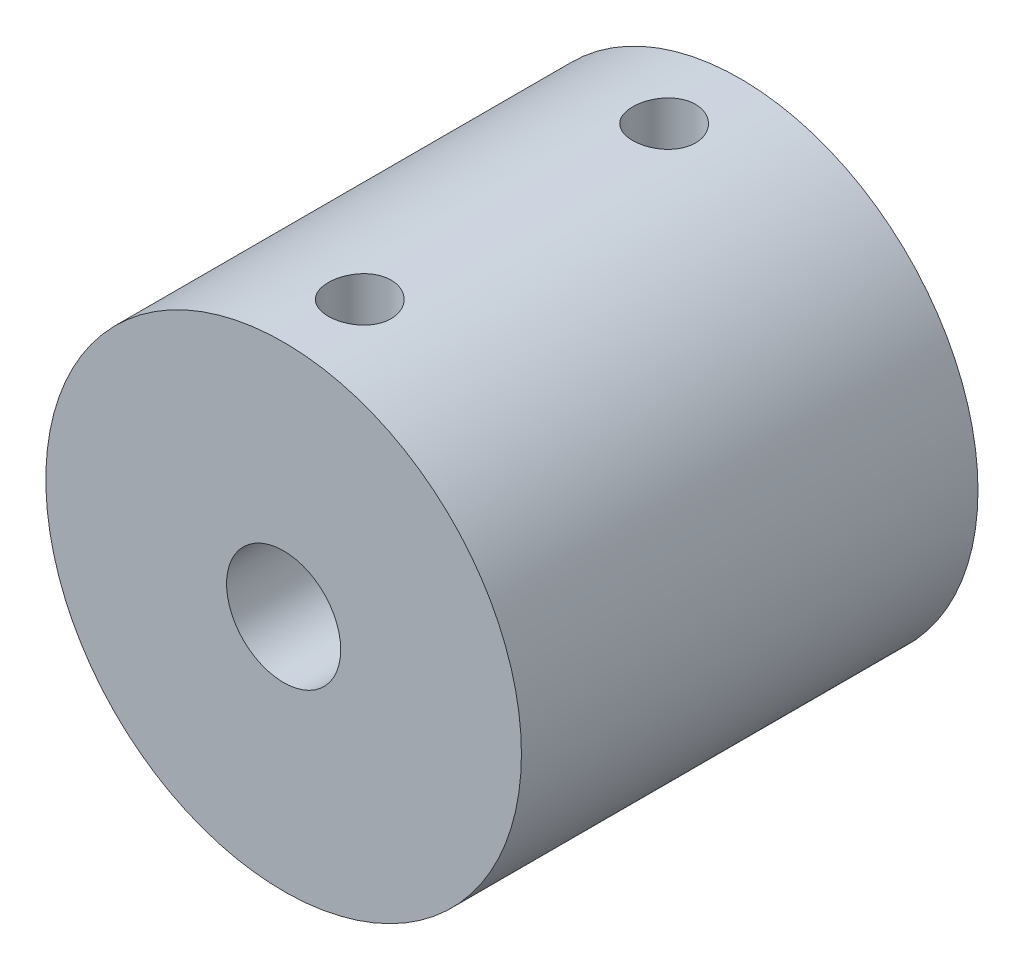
ISO-10303-21;
HEADER;
FILE_DESCRIPTION(('STEP AP214'),'2;1');
FILE_NAME('part.step','',(''),(''),'','','');
FILE_SCHEMA(('AUTOMOTIVE_DESIGN { 1 0 10303 214 1 1 1 1 }'));
ENDSEC;
DATA;
#1=APPLICATION_CONTEXT('core data for automotive mechanical design processes');
#2=APPLICATION_PROTOCOL_DEFINITION('international standard','automotive_design',2000,#1);
#3=PRODUCT_CONTEXT('',#1,'mechanical');
#4=PRODUCT('Part','Part','',(#3));
#5=PRODUCT_RELATED_PRODUCT_CATEGORY('part','',(#4));
#6=PRODUCT_DEFINITION_FORMATION('','',#4);
#7=PRODUCT_DEFINITION_CONTEXT('part definition',#1,'design');
#8=PRODUCT_DEFINITION('design','',#6,#7);
#9=PRODUCT_DEFINITION_SHAPE('','',#8);
#10=(LENGTH_UNIT() NAMED_UNIT(*) SI_UNIT(.MILLI.,.METRE.));
#11=(NAMED_UNIT(*) PLANE_ANGLE_UNIT() SI_UNIT($,.RADIAN.));
#12=(NAMED_UNIT(*) SI_UNIT($,.STERADIAN.) SOLID_ANGLE_UNIT());
#13=UNCERTAINTY_MEASURE_WITH_UNIT(LENGTH_MEASURE(1.E-05),#10,'distance_accuracy_value','');
#14=(GEOMETRIC_REPRESENTATION_CONTEXT(3) GLOBAL_UNCERTAINTY_ASSIGNED_CONTEXT((#13)) GLOBAL_UNIT_ASSIGNED_CONTEXT((#10,
#11,#12)) REPRESENTATION_CONTEXT('',''));
#15=CARTESIAN_POINT('',(0.,0.,0.));
#16=DIRECTION('',(0.,0.,1.));
#17=DIRECTION('',(1.,0.,0.));
#18=AXIS2_PLACEMENT_3D('',#15,#16,#17);
#19=CARTESIAN_POINT('',(0.,0.,24.));
#20=DIRECTION('',(0.,0.,1.));
#21=DIRECTION('',(1.,0.,0.));
#22=AXIS2_PLACEMENT_3D('',#19,#20,#21);
#23=PLANE('',#22);
#24=CARTESIAN_POINT('',(0.,0.,24.));
#25=DIRECTION('',(0.,0.,1.));
#26=DIRECTION('',(1.,0.,0.));
#27=AXIS2_PLACEMENT_3D('',#24,#25,#26);
#28=CIRCLE('',#27,12.5);
#29=CARTESIAN_POINT('',(12.5,0.,24.));
#30=VERTEX_POINT('',#29);
#31=EDGE_CURVE('E10',#30,#30,#28,.T.);
#32=ORIENTED_EDGE('',*,*,#31,.T.);
#33=EDGE_LOOP('',(#32));
#34=FACE_BOUND('',#33,.T.);
#35=CARTESIAN_POINT('',(0.,0.,24.));
#36=DIRECTION('',(0.,0.,1.));
#37=DIRECTION('',(1.,0.,0.));
#38=AXIS2_PLACEMENT_3D('',#35,#36,#37);
#39=CIRCLE('',#38,3.);
#40=CARTESIAN_POINT('',(3.,0.,24.));
#41=VERTEX_POINT('',#40);
#42=EDGE_CURVE('E51',#41,#41,#39,.T.);
#43=ORIENTED_EDGE('',*,*,#42,.F.);
#44=EDGE_LOOP('',(#43));
#45=FACE_BOUND('',#44,.T.);
#46=ADVANCED_FACE('F39',(#34,#45),#23,.T.);
#47=CARTESIAN_POINT('',(0.,0.,0.));
#48=DIRECTION('',(0.,0.,1.));
#49=DIRECTION('',(1.,0.,0.));
#50=AXIS2_PLACEMENT_3D('',#47,#48,#49);
#51=PLANE('',#50);
#52=CARTESIAN_POINT('',(0.,0.,0.));
#53=DIRECTION('',(0.,0.,1.));
#54=DIRECTION('',(1.,0.,0.));
#55=AXIS2_PLACEMENT_3D('',#52,#53,#54);
#56=CIRCLE('',#55,12.5);
#57=CARTESIAN_POINT('',(12.5,0.,0.));
#58=VERTEX_POINT('',#57);
#59=EDGE_CURVE('E44',#58,#58,#56,.T.);
#60=ORIENTED_EDGE('',*,*,#59,.F.);
#61=EDGE_LOOP('',(#60));
#62=FACE_BOUND('',#61,.T.);
#63=CARTESIAN_POINT('',(0.,0.,0.));
#64=DIRECTION('',(0.,0.,1.));
#65=DIRECTION('',(1.,0.,0.));
#66=AXIS2_PLACEMENT_3D('',#63,#64,#65);
#67=CIRCLE('',#66,3.);
#68=CARTESIAN_POINT('',(3.,0.,0.));
#69=VERTEX_POINT('',#68);
#70=EDGE_CURVE('E53',#69,#69,#67,.T.);
#71=ORIENTED_EDGE('',*,*,#70,.T.);
#72=EDGE_LOOP('',(#71));
#73=FACE_BOUND('',#72,.T.);
#74=ADVANCED_FACE('F87',(#62,#73),#51,.F.);
#75=CARTESIAN_POINT('',(0.,0.,24.));
#76=DIRECTION('',(0.,0.,-1.));
#77=DIRECTION('',(-1.,0.,0.));
#78=AXIS2_PLACEMENT_3D('',#75,#76,#77);
#79=CYLINDRICAL_SURFACE('',#78,12.5);
#80=CARTESIAN_POINT('',(0.,12.5,5.65));
#81=CARTESIAN_POINT('',(-0.0922509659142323,12.4999986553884,5.64999610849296));
#82=CARTESIAN_POINT('',(-0.184558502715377,12.498968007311,5.64223732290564));
#83=CARTESIAN_POINT('',(-0.366601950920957,12.4949556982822,5.61141019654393));
#84=CARTESIAN_POINT('',(-0.456335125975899,12.4919720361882,5.58832615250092));
#85=CARTESIAN_POINT('',(-0.630568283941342,12.4843896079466,5.52754306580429));
#86=CARTESIAN_POINT('',(-0.715071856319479,12.4797919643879,5.48985417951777));
#87=CARTESIAN_POINT('',(-0.876539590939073,12.4694920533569,5.40095418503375));
#88=CARTESIAN_POINT('',(-0.953504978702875,12.4637899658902,5.34974527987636));
#89=CARTESIAN_POINT('',(-1.09819718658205,12.4518781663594,5.2349246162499));
#90=CARTESIAN_POINT('',(-1.16587128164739,12.4456658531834,5.17124667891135));
#91=CARTESIAN_POINT('',(-1.28960557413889,12.4334545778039,5.0334377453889));
#92=CARTESIAN_POINT('',(-1.34566516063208,12.4274556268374,4.95930619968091));
#93=CARTESIAN_POINT('',(-1.44477796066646,12.4163248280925,4.80234850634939));
#94=CARTESIAN_POINT('',(-1.48778133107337,12.4111963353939,4.71949062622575));
#95=CARTESIAN_POINT('',(-1.55924262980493,12.4024218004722,4.54764984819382));
#96=CARTESIAN_POINT('',(-1.58770117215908,12.3987756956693,4.45866720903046));
#97=CARTESIAN_POINT('',(-1.62910377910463,12.3934038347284,4.27765215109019));
#98=CARTESIAN_POINT('',(-1.64213723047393,12.3916670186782,4.18564051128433));
#99=CARTESIAN_POINT('',(-1.6525963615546,12.3902766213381,4.00072085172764));
#100=CARTESIAN_POINT('',(-1.65002273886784,12.3906229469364,3.90781287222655));
#101=CARTESIAN_POINT('',(-1.62941406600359,12.3933495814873,3.72436300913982));
#102=CARTESIAN_POINT('',(-1.61147776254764,12.395716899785,3.63380981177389));
#103=CARTESIAN_POINT('',(-1.56080707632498,12.4021985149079,3.45700984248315));
#104=CARTESIAN_POINT('',(-1.52807236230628,12.4063128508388,3.3707631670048));
#105=CARTESIAN_POINT('',(-1.44862884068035,12.4158395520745,3.20471936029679));
#106=CARTESIAN_POINT('',(-1.40187740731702,12.4212558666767,3.12494285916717));
#107=CARTESIAN_POINT('',(-1.29575800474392,12.4327732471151,2.97433012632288));
#108=CARTESIAN_POINT('',(-1.23638939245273,12.4388743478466,2.90349435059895));
#109=CARTESIAN_POINT('',(-1.1061749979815,12.4511315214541,2.77220089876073));
#110=CARTESIAN_POINT('',(-1.03524415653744,12.4572876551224,2.711827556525));
#111=CARTESIAN_POINT('',(-0.88421085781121,12.4689172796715,2.6038303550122));
#112=CARTESIAN_POINT('',(-0.804108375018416,12.4743907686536,2.55620653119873));
#113=CARTESIAN_POINT('',(-0.636938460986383,12.484042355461,2.4750590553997));
#114=CARTESIAN_POINT('',(-0.549868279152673,12.4882199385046,2.44154100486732));
#115=CARTESIAN_POINT('',(-0.371267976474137,12.4948044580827,2.38962514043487));
#116=CARTESIAN_POINT('',(-0.27973808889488,12.4972114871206,2.37122653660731));
#117=CARTESIAN_POINT('',(-0.0955454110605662,12.4999716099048,2.35018188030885));
#118=CARTESIAN_POINT('',(-0.00289610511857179,12.5003398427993,2.34741971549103));
#119=CARTESIAN_POINT('',(0.181544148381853,12.4990218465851,2.35741945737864));
#120=CARTESIAN_POINT('',(0.273335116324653,12.4973356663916,2.37018099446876));
#121=CARTESIAN_POINT('',(0.453108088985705,12.4921077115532,2.4107693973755));
#122=CARTESIAN_POINT('',(0.541102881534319,12.4885727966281,2.43854058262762));
#123=CARTESIAN_POINT('',(0.711186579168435,12.4800429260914,2.50830185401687));
#124=CARTESIAN_POINT('',(0.793275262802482,12.4750479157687,2.55029247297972));
#125=CARTESIAN_POINT('',(0.949733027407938,12.4641165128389,2.64757933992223));
#126=CARTESIAN_POINT('',(1.02405527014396,12.4581748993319,2.70295031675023));
#127=CARTESIAN_POINT('',(1.16239311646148,12.4460304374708,2.82532084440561));
#128=CARTESIAN_POINT('',(1.22640826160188,12.4398275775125,2.89232091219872));
#129=CARTESIAN_POINT('',(1.34272949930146,12.427812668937,3.03656066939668));
#130=CARTESIAN_POINT('',(1.39495839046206,12.422003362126,3.11386287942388));
#131=CARTESIAN_POINT('',(1.48569034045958,12.4114793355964,3.27621075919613));
#132=CARTESIAN_POINT('',(1.52419370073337,12.40676459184,3.36125625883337));
#133=CARTESIAN_POINT('',(1.5862580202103,12.3989825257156,3.53643245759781));
#134=CARTESIAN_POINT('',(1.60986174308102,12.395910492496,3.62654778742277));
#135=CARTESIAN_POINT('',(1.64159408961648,12.3917484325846,3.80950632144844));
#136=CARTESIAN_POINT('',(1.64972352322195,12.390658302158,3.90234938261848));
#137=CARTESIAN_POINT('',(1.65026050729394,12.3905867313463,4.08735951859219));
#138=CARTESIAN_POINT('',(1.64278936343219,12.3915890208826,4.17952625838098));
#139=CARTESIAN_POINT('',(1.61259495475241,12.3955542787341,4.36128141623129));
#140=CARTESIAN_POINT('',(1.58987169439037,12.3985172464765,4.45086983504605));
#141=CARTESIAN_POINT('',(1.52985734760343,12.4060648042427,4.62490463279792));
#142=CARTESIAN_POINT('',(1.49257280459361,12.4106486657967,4.7093533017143));
#143=CARTESIAN_POINT('',(1.40450618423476,12.4209226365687,4.87081546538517));
#144=CARTESIAN_POINT('',(1.35372386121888,12.4266127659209,4.94782882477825));
#145=CARTESIAN_POINT('',(1.23965546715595,12.4385110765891,5.09285344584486));
#146=CARTESIAN_POINT('',(1.17627910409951,12.4447228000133,5.1607934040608));
#147=CARTESIAN_POINT('',(1.03901112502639,12.4569335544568,5.28511935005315));
#148=CARTESIAN_POINT('',(0.965117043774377,12.4629325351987,5.34150262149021));
#149=CARTESIAN_POINT('',(0.808549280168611,12.4740702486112,5.44132111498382));
#150=CARTESIAN_POINT('',(0.725839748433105,12.4792052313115,5.48470050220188));
#151=CARTESIAN_POINT('',(0.554286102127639,12.4879988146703,5.55689083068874));
#152=CARTESIAN_POINT('',(0.465448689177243,12.4916589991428,5.58571740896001));
#153=CARTESIAN_POINT('',(0.313472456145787,12.4962204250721,5.62117734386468));
#154=CARTESIAN_POINT('',(0.251287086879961,12.4976307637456,5.63197005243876));
#155=CARTESIAN_POINT('',(0.126076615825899,12.4995210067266,5.6463826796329));
#156=CARTESIAN_POINT('',(0.0630515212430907,12.5000009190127,5.6500026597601));
#157=CARTESIAN_POINT('',(0.,12.5,5.65));
#158=B_SPLINE_CURVE_WITH_KNOTS('',3,(#80,#81,#82,#83,#84,#85,#86,#87,#88,#89,#90,#91,#92,#93,
#94,#95,#96,#97,#98,#99,#100,#101,#102,#103,#104,#105,#106,#107,#108,#109,#110,#111,#112,#113,
#114,#115,#116,#117,#118,#119,#120,#121,#122,#123,#124,#125,#126,#127,#128,#129,#130,#131,#132,
#133,#134,#135,#136,#137,#138,#139,#140,#141,#142,#143,#144,#145,#146,#147,#148,#149,#150,#151,
#152,#153,#154,#155,#156,#157),.UNSPECIFIED.,.T.,.F.,(4,2,2,2,2,2,2,2,2,2,2,2,2,2,2,2,2,2,2,2,2,
2,2,2,2,2,2,2,2,2,2,2,2,2,2,2,2,2,4),(0.,0.27652256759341,0.553328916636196,0.829943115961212,
1.106512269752,1.38459116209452,1.66268467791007,1.94182686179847,2.22095726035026,
2.49846208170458,2.77595449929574,3.05167655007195,3.32740477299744,3.60398015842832,
3.88056964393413,4.15929423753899,4.43801960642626,4.71685555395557,4.99567693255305,
5.27242510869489,5.5491666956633,5.82488864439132,6.10062092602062,6.37793027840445,
6.65525196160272,6.93434056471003,7.21342303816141,7.49170082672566,7.76996404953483,
8.04607163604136,8.32217914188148,8.59816271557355,8.87415131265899,9.15219502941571,
9.43030402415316,9.70959057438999,9.98857638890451,10.1775751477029,10.3665722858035),.UNSPECIFIED.);
#159=CARTESIAN_POINT('',(0.,12.5,5.65));
#160=VERTEX_POINT('',#159);
#161=EDGE_CURVE('E104',#160,#160,#158,.T.);
#162=ORIENTED_EDGE('',*,*,#161,.T.);
#163=EDGE_LOOP('',(#162));
#164=FACE_BOUND('',#163,.T.);
#165=CARTESIAN_POINT('',(0.,12.5,21.65));
#166=CARTESIAN_POINT('',(-0.0922509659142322,12.4999986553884,21.649996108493));
#167=CARTESIAN_POINT('',(-0.184558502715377,12.498968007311,21.6422373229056));
#168=CARTESIAN_POINT('',(-0.366601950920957,12.4949556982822,21.6114101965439));
#169=CARTESIAN_POINT('',(-0.4563351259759,12.4919720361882,21.5883261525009));
#170=CARTESIAN_POINT('',(-0.630568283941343,12.4843896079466,21.5275430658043));
#171=CARTESIAN_POINT('',(-0.715071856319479,12.4797919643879,21.4898541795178));
#172=CARTESIAN_POINT('',(-0.876539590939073,12.4694920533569,21.4009541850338));
#173=CARTESIAN_POINT('',(-0.953504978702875,12.4637899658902,21.3497452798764));
#174=CARTESIAN_POINT('',(-1.09819718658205,12.4518781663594,21.2349246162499));
#175=CARTESIAN_POINT('',(-1.16587128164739,12.4456658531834,21.1712466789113));
#176=CARTESIAN_POINT('',(-1.28960557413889,12.4334545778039,21.0334377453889));
#177=CARTESIAN_POINT('',(-1.34566516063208,12.4274556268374,20.9593061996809));
#178=CARTESIAN_POINT('',(-1.44477796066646,12.4163248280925,20.8023485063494));
#179=CARTESIAN_POINT('',(-1.48778133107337,12.4111963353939,20.7194906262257));
#180=CARTESIAN_POINT('',(-1.55924262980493,12.4024218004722,20.5476498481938));
#181=CARTESIAN_POINT('',(-1.58770117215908,12.3987756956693,20.4586672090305));
#182=CARTESIAN_POINT('',(-1.62910377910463,12.3934038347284,20.2776521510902));
#183=CARTESIAN_POINT('',(-1.64213723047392,12.3916670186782,20.1856405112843));
#184=CARTESIAN_POINT('',(-1.6525963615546,12.3902766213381,20.0007208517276));
#185=CARTESIAN_POINT('',(-1.65002273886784,12.3906229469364,19.9078128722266));
#186=CARTESIAN_POINT('',(-1.6294140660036,12.3933495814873,19.7243630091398));
#187=CARTESIAN_POINT('',(-1.61147776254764,12.395716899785,19.6338098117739));
#188=CARTESIAN_POINT('',(-1.56080707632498,12.4021985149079,19.4570098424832));
#189=CARTESIAN_POINT('',(-1.52807236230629,12.4063128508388,19.3707631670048));
#190=CARTESIAN_POINT('',(-1.44862884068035,12.4158395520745,19.2047193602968));
#191=CARTESIAN_POINT('',(-1.40187740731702,12.4212558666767,19.1249428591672));
#192=CARTESIAN_POINT('',(-1.29575800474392,12.4327732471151,18.9743301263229));
#193=CARTESIAN_POINT('',(-1.23638939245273,12.4388743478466,18.9034943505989));
#194=CARTESIAN_POINT('',(-1.10617499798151,12.4511315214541,18.7722008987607));
#195=CARTESIAN_POINT('',(-1.03524415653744,12.4572876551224,18.711827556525));
#196=CARTESIAN_POINT('',(-0.884210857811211,12.4689172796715,18.6038303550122));
#197=CARTESIAN_POINT('',(-0.804108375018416,12.4743907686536,18.5562065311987));
#198=CARTESIAN_POINT('',(-0.636938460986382,12.484042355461,18.4750590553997));
#199=CARTESIAN_POINT('',(-0.549868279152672,12.4882199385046,18.4415410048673));
#200=CARTESIAN_POINT('',(-0.371267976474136,12.4948044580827,18.3896251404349));
#201=CARTESIAN_POINT('',(-0.27973808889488,12.4972114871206,18.3712265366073));
#202=CARTESIAN_POINT('',(-0.095545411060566,12.4999716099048,18.3501818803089));
#203=CARTESIAN_POINT('',(-0.00289610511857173,12.5003398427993,18.347419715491));
#204=CARTESIAN_POINT('',(0.181544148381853,12.4990218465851,18.3574194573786));
#205=CARTESIAN_POINT('',(0.273335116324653,12.4973356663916,18.3701809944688));
#206=CARTESIAN_POINT('',(0.453108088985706,12.4921077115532,18.4107693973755));
#207=CARTESIAN_POINT('',(0.54110288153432,12.4885727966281,18.4385405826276));
#208=CARTESIAN_POINT('',(0.711186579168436,12.4800429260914,18.5083018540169));
#209=CARTESIAN_POINT('',(0.793275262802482,12.4750479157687,18.5502924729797));
#210=CARTESIAN_POINT('',(0.949733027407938,12.4641165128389,18.6475793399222));
#211=CARTESIAN_POINT('',(1.02405527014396,12.4581748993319,18.7029503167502));
#212=CARTESIAN_POINT('',(1.16239311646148,12.4460304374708,18.8253208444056));
#213=CARTESIAN_POINT('',(1.22640826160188,12.4398275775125,18.8923209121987));
#214=CARTESIAN_POINT('',(1.34272949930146,12.427812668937,19.0365606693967));
#215=CARTESIAN_POINT('',(1.39495839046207,12.422003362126,19.1138628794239));
#216=CARTESIAN_POINT('',(1.48569034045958,12.4114793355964,19.2762107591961));
#217=CARTESIAN_POINT('',(1.52419370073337,12.40676459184,19.3612562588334));
#218=CARTESIAN_POINT('',(1.5862580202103,12.3989825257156,19.5364324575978));
#219=CARTESIAN_POINT('',(1.60986174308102,12.395910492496,19.6265477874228));
#220=CARTESIAN_POINT('',(1.64159408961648,12.3917484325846,19.8095063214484));
#221=CARTESIAN_POINT('',(1.64972352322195,12.390658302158,19.9023493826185));
#222=CARTESIAN_POINT('',(1.65026050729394,12.3905867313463,20.0873595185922));
#223=CARTESIAN_POINT('',(1.64278936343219,12.3915890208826,20.179526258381));
#224=CARTESIAN_POINT('',(1.61259495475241,12.3955542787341,20.3612814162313));
#225=CARTESIAN_POINT('',(1.58987169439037,12.3985172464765,20.4508698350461));
#226=CARTESIAN_POINT('',(1.52985734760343,12.4060648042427,20.6249046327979));
#227=CARTESIAN_POINT('',(1.49257280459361,12.4106486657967,20.7093533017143));
#228=CARTESIAN_POINT('',(1.40450618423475,12.4209226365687,20.8708154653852));
#229=CARTESIAN_POINT('',(1.35372386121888,12.4266127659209,20.9478288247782));
#230=CARTESIAN_POINT('',(1.23965546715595,12.4385110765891,21.0928534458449));
#231=CARTESIAN_POINT('',(1.17627910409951,12.4447228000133,21.1607934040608));
#232=CARTESIAN_POINT('',(1.03901112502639,12.4569335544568,21.2851193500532));
#233=CARTESIAN_POINT('',(0.965117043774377,12.4629325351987,21.3415026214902));
#234=CARTESIAN_POINT('',(0.808549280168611,12.4740702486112,21.4413211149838));
#235=CARTESIAN_POINT('',(0.725839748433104,12.4792052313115,21.4847005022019));
#236=CARTESIAN_POINT('',(0.554286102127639,12.4879988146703,21.5568908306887));
#237=CARTESIAN_POINT('',(0.465448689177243,12.4916589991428,21.58571740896));
#238=CARTESIAN_POINT('',(0.313472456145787,12.4962204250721,21.6211773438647));
#239=CARTESIAN_POINT('',(0.251287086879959,12.4976307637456,21.6319700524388));
#240=CARTESIAN_POINT('',(0.126076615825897,12.4995210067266,21.6463826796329));
#241=CARTESIAN_POINT('',(0.06305152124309,12.5000009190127,21.6500026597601));
#242=CARTESIAN_POINT('',(0.,12.5,21.65));
#243=B_SPLINE_CURVE_WITH_KNOTS('',3,(#165,#166,#167,#168,#169,#170,#171,#172,#173,#174,#175,
#176,#177,#178,#179,#180,#181,#182,#183,#184,#185,#186,#187,#188,#189,#190,#191,#192,#193,#194,
#195,#196,#197,#198,#199,#200,#201,#202,#203,#204,#205,#206,#207,#208,#209,#210,#211,#212,#213,
#214,#215,#216,#217,#218,#219,#220,#221,#222,#223,#224,#225,#226,#227,#228,#229,#230,#231,#232,
#233,#234,#235,#236,#237,#238,#239,#240,#241,#242),.UNSPECIFIED.,.T.,.F.,(4,2,2,2,2,2,2,2,2,2,2,
2,2,2,2,2,2,2,2,2,2,2,2,2,2,2,2,2,2,2,2,2,2,2,2,2,2,2,4),(0.,0.27652256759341,0.553328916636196,
0.829943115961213,1.106512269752,1.38459116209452,1.66268467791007,1.94182686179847,
2.22095726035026,2.49846208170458,2.77595449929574,3.05167655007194,3.32740477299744,
3.60398015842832,3.88056964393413,4.15929423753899,4.43801960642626,4.71685555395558,
4.99567693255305,5.27242510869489,5.54916669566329,5.82488864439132,6.10062092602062,
6.37793027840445,6.65525196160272,6.93434056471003,7.21342303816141,7.49170082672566,
7.76996404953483,8.04607163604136,8.32217914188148,8.59816271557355,8.87415131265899,
9.15219502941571,9.43030402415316,9.70959057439,9.98857638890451,10.1775751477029,
10.3665722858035),.UNSPECIFIED.);
#244=CARTESIAN_POINT('',(0.,12.5,21.65));
#245=VERTEX_POINT('',#244);
#246=EDGE_CURVE('E56',#245,#245,#243,.T.);
#247=ORIENTED_EDGE('',*,*,#246,.T.);
#248=EDGE_LOOP('',(#247));
#249=FACE_BOUND('',#248,.T.);
#250=ORIENTED_EDGE('',*,*,#31,.F.);
#251=EDGE_LOOP('',(#250));
#252=FACE_BOUND('',#251,.T.);
#253=ORIENTED_EDGE('',*,*,#59,.T.);
#254=EDGE_LOOP('',(#253));
#255=FACE_BOUND('',#254,.T.);
#256=ADVANCED_FACE('F41',(#164,#249,#252,#255),#79,.T.);
#257=CARTESIAN_POINT('',(0.,0.,24.));
#258=DIRECTION('',(0.,0.,-1.));
#259=DIRECTION('',(-1.,0.,0.));
#260=AXIS2_PLACEMENT_3D('',#257,#258,#259);
#261=CYLINDRICAL_SURFACE('',#260,3.);
#262=CARTESIAN_POINT('',(0.,3.,5.65));
#263=CARTESIAN_POINT('',(-0.0856699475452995,2.99999513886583,5.64999461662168));
#264=CARTESIAN_POINT('',(-0.171409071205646,2.99629302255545,5.64328935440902));
#265=CARTESIAN_POINT('',(-0.340286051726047,2.9818478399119,5.61679778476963));
#266=CARTESIAN_POINT('',(-0.42342019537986,2.97109516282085,5.59699362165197));
#267=CARTESIAN_POINT('',(-0.584401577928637,2.9436571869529,5.54534553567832));
#268=CARTESIAN_POINT('',(-0.662269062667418,2.9269963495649,5.51355122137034));
#269=CARTESIAN_POINT('',(-0.811408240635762,2.8892116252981,5.43912133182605));
#270=CARTESIAN_POINT('',(-0.882679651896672,2.86808754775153,5.39648529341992));
#271=CARTESIAN_POINT('',(-1.02211619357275,2.82153252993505,5.29828466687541));
#272=CARTESIAN_POINT('',(-1.08973037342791,2.79590528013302,5.24203247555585));
#273=CARTESIAN_POINT('',(-1.21508634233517,2.74375354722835,5.1197083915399));
#274=CARTESIAN_POINT('',(-1.2728189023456,2.71722825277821,5.05362742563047));
#275=CARTESIAN_POINT('',(-1.38251917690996,2.66321895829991,4.90577401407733));
#276=CARTESIAN_POINT('',(-1.43335857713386,2.635897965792,4.82309703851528));
#277=CARTESIAN_POINT('',(-1.52021547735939,2.58678336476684,4.64877263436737));
#278=CARTESIAN_POINT('',(-1.5562446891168,2.56498539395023,4.55713236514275));
#279=CARTESIAN_POINT('',(-1.60989890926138,2.53163475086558,4.3732305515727));
#280=CARTESIAN_POINT('',(-1.62854263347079,2.51952192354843,4.28137384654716));
#281=CARTESIAN_POINT('',(-1.64991120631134,2.5055890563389,4.09511055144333));
#282=CARTESIAN_POINT('',(-1.65265887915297,2.50375425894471,4.00070781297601));
#283=CARTESIAN_POINT('',(-1.64290000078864,2.51015646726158,3.82757164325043));
#284=CARTESIAN_POINT('',(-1.63265157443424,2.51690299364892,3.74864024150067));
#285=CARTESIAN_POINT('',(-1.60118639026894,2.53703527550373,3.59387058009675));
#286=CARTESIAN_POINT('',(-1.5799646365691,2.55042405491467,3.5180337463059));
#287=CARTESIAN_POINT('',(-1.52687641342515,2.58256130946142,3.3695176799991));
#288=CARTESIAN_POINT('',(-1.49479033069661,2.60141910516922,3.2969417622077));
#289=CARTESIAN_POINT('',(-1.42107429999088,2.64240902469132,3.15782897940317));
#290=CARTESIAN_POINT('',(-1.37944023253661,2.66454256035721,3.09129473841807));
#291=CARTESIAN_POINT('',(-1.28018349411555,2.71379040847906,2.95510521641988));
#292=CARTESIAN_POINT('',(-1.22107458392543,2.74113957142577,2.88661394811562));
#293=CARTESIAN_POINT('',(-1.09224532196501,2.79497377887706,2.75997341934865));
#294=CARTESIAN_POINT('',(-1.02251777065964,2.82145822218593,2.70183123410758));
#295=CARTESIAN_POINT('',(-0.868605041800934,2.87272134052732,2.59378517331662));
#296=CARTESIAN_POINT('',(-0.783763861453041,2.89726648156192,2.54469535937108));
#297=CARTESIAN_POINT('',(-0.605352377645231,2.93971528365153,2.46191924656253));
#298=CARTESIAN_POINT('',(-0.511790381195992,2.95762518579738,2.42821846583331));
#299=CARTESIAN_POINT('',(-0.327907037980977,2.98333345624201,2.38038778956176));
#300=CARTESIAN_POINT('',(-0.238095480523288,2.99191822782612,2.36472744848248));
#301=CARTESIAN_POINT('',(-0.0567325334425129,3.00083376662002,2.34846917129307));
#302=CARTESIAN_POINT('',(0.0348177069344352,3.00116980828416,2.34786161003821));
#303=CARTESIAN_POINT('',(0.207487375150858,2.99394177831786,2.36103451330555));
#304=CARTESIAN_POINT('',(0.28875177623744,2.98714659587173,2.37341460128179));
#305=CARTESIAN_POINT('',(0.447838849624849,2.96746793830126,2.40984259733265));
#306=CARTESIAN_POINT('',(0.525661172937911,2.95458384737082,2.43389168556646));
#307=CARTESIAN_POINT('',(0.677753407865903,2.92349378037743,2.49335761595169));
#308=CARTESIAN_POINT('',(0.751904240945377,2.90517475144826,2.52901769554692));
#309=CARTESIAN_POINT('',(0.893363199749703,2.86484215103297,2.61037134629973));
#310=CARTESIAN_POINT('',(0.960668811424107,2.8428272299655,2.65606858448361));
#311=CARTESIAN_POINT('',(1.09455456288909,2.79420331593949,2.76204471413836));
#312=CARTESIAN_POINT('',(1.16021004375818,2.76735592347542,2.823383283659));
#313=CARTESIAN_POINT('',(1.28079913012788,2.71365440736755,2.9559244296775));
#314=CARTESIAN_POINT('',(1.33572155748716,2.6868003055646,3.02713715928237));
#315=CARTESIAN_POINT('',(1.43747254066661,2.63385875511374,3.18416419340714));
#316=CARTESIAN_POINT('',(1.48334076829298,2.60799295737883,3.27068307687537));
#317=CARTESIAN_POINT('',(1.55942876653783,2.56323063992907,3.45199407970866));
#318=CARTESIAN_POINT('',(1.58967133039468,2.54432398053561,3.54677391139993));
#319=CARTESIAN_POINT('',(1.6306246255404,2.51825420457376,3.73226237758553));
#320=CARTESIAN_POINT('',(1.64294477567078,2.51013022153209,3.8224747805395));
#321=CARTESIAN_POINT('',(1.65249034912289,2.50386093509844,4.00401046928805));
#322=CARTESIAN_POINT('',(1.64972872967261,2.50570706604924,4.09533273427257));
#323=CARTESIAN_POINT('',(1.63075691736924,2.51807870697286,4.26321952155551));
#324=CARTESIAN_POINT('',(1.61642825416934,2.52738874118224,4.34010097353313));
#325=CARTESIAN_POINT('',(1.57741079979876,2.55192145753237,4.49019541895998));
#326=CARTESIAN_POINT('',(1.55271775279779,2.56714656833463,4.56340689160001));
#327=CARTESIAN_POINT('',(1.492056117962,2.60289749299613,4.70913964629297));
#328=CARTESIAN_POINT('',(1.45548954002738,2.62369085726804,4.7813439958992));
#329=CARTESIAN_POINT('',(1.37268509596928,2.66794671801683,4.91907602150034));
#330=CARTESIAN_POINT('',(1.32644209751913,2.69141062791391,4.98460012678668));
#331=CARTESIAN_POINT('',(1.21715006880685,2.74276036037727,5.11784973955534));
#332=CARTESIAN_POINT('',(1.15260264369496,2.77076245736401,5.18430823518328));
#333=CARTESIAN_POINT('',(1.01279351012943,2.82486614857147,5.30588442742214));
#334=CARTESIAN_POINT('',(0.937524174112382,2.85096636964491,5.360993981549));
#335=CARTESIAN_POINT('',(0.774887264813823,2.89948189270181,5.45993803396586));
#336=CARTESIAN_POINT('',(0.687189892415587,2.92173740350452,5.50331356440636));
#337=CARTESIAN_POINT('',(0.504223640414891,2.95878417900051,5.57410971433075));
#338=CARTESIAN_POINT('',(0.408974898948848,2.97359457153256,5.60157124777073));
#339=CARTESIAN_POINT('',(0.26051061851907,2.98911434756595,5.63014205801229));
#340=CARTESIAN_POINT('',(0.20878305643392,2.99318008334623,5.63757243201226));
#341=CARTESIAN_POINT('',(0.104712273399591,2.99862437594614,5.64750301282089));
#342=CARTESIAN_POINT('',(0.0523690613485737,3.00000297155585,5.65000329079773));
#343=CARTESIAN_POINT('',(0.,3.,5.65));
#344=B_SPLINE_CURVE_WITH_KNOTS('',3,(#262,#263,#264,#265,#266,#267,#268,#269,#270,#271,#272,
#273,#274,#275,#276,#277,#278,#279,#280,#281,#282,#283,#284,#285,#286,#287,#288,#289,#290,#291,
#292,#293,#294,#295,#296,#297,#298,#299,#300,#301,#302,#303,#304,#305,#306,#307,#308,#309,#310,
#311,#312,#313,#314,#315,#316,#317,#318,#319,#320,#321,#322,#323,#324,#325,#326,#327,#328,#329,
#330,#331,#332,#333,#334,#335,#336,#337,#338,#339,#340,#341,#342,#343),.UNSPECIFIED.,.T.,.F.,(4,
2,2,2,2,2,2,2,2,2,2,2,2,2,2,2,2,2,2,2,2,2,2,2,2,2,2,2,2,2,2,2,2,2,2,2,2,2,2,2,4),(0.,
0.256799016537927,0.513948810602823,0.770046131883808,1.02615439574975,1.29988051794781,
1.57386091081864,1.87483382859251,2.17556827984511,2.45730761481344,2.7386423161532,
2.97715628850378,3.21577894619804,3.4595457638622,3.70341795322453,3.98576982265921,
4.26831398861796,4.5698079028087,4.8710175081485,5.14417314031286,5.41715410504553,
5.66345591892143,5.90978264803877,6.16164305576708,6.41359563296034,6.69375293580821,
6.97420047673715,7.27643629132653,7.57822997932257,7.85076329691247,8.12306250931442,
8.35830132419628,8.59363682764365,8.84338665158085,9.09326927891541,9.38234984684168,
9.6716371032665,9.97098879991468,10.2695674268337,10.4265480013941,10.5835263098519),.UNSPECIFIED.);
#345=CARTESIAN_POINT('',(0.,3.,5.65));
#346=VERTEX_POINT('',#345);
#347=EDGE_CURVE('E109',#346,#346,#344,.T.);
#348=ORIENTED_EDGE('',*,*,#347,.F.);
#349=EDGE_LOOP('',(#348));
#350=FACE_BOUND('',#349,.T.);
#351=CARTESIAN_POINT('',(0.,3.,21.65));
#352=CARTESIAN_POINT('',(-0.0856699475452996,2.99999513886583,21.6499946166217));
#353=CARTESIAN_POINT('',(-0.171409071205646,2.99629302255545,21.643289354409));
#354=CARTESIAN_POINT('',(-0.340286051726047,2.9818478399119,21.6167977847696));
#355=CARTESIAN_POINT('',(-0.42342019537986,2.97109516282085,21.596993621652));
#356=CARTESIAN_POINT('',(-0.584401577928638,2.9436571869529,21.5453455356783));
#357=CARTESIAN_POINT('',(-0.66226906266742,2.92699634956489,21.5135512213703));
#358=CARTESIAN_POINT('',(-0.811408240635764,2.8892116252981,21.4391213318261));
#359=CARTESIAN_POINT('',(-0.882679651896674,2.86808754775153,21.3964852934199));
#360=CARTESIAN_POINT('',(-1.02211619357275,2.82153252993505,21.2982846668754));
#361=CARTESIAN_POINT('',(-1.08973037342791,2.79590528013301,21.2420324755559));
#362=CARTESIAN_POINT('',(-1.21508634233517,2.74375354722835,21.1197083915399));
#363=CARTESIAN_POINT('',(-1.2728189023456,2.71722825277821,21.0536274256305));
#364=CARTESIAN_POINT('',(-1.38251917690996,2.66321895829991,20.9057740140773));
#365=CARTESIAN_POINT('',(-1.43335857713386,2.635897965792,20.8230970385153));
#366=CARTESIAN_POINT('',(-1.52021547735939,2.58678336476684,20.6487726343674));
#367=CARTESIAN_POINT('',(-1.5562446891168,2.56498539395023,20.5571323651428));
#368=CARTESIAN_POINT('',(-1.60989890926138,2.53163475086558,20.3732305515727));
#369=CARTESIAN_POINT('',(-1.62854263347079,2.51952192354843,20.2813738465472));
#370=CARTESIAN_POINT('',(-1.64991120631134,2.5055890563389,20.0951105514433));
#371=CARTESIAN_POINT('',(-1.65265887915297,2.50375425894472,20.000707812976));
#372=CARTESIAN_POINT('',(-1.64290000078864,2.51015646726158,19.8275716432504));
#373=CARTESIAN_POINT('',(-1.63265157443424,2.51690299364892,19.7486402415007));
#374=CARTESIAN_POINT('',(-1.60118639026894,2.53703527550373,19.5938705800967));
#375=CARTESIAN_POINT('',(-1.5799646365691,2.55042405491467,19.5180337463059));
#376=CARTESIAN_POINT('',(-1.52687641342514,2.58256130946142,19.3695176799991));
#377=CARTESIAN_POINT('',(-1.49479033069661,2.60141910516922,19.2969417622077));
#378=CARTESIAN_POINT('',(-1.42107429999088,2.64240902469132,19.1578289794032));
#379=CARTESIAN_POINT('',(-1.3794402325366,2.66454256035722,19.0912947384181));
#380=CARTESIAN_POINT('',(-1.28018349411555,2.71379040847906,18.9551052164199));
#381=CARTESIAN_POINT('',(-1.22107458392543,2.74113957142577,18.8866139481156));
#382=CARTESIAN_POINT('',(-1.09224532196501,2.79497377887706,18.7599734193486));
#383=CARTESIAN_POINT('',(-1.02251777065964,2.82145822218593,18.7018312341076));
#384=CARTESIAN_POINT('',(-0.868605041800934,2.87272134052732,18.5937851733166));
#385=CARTESIAN_POINT('',(-0.78376386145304,2.89726648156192,18.5446953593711));
#386=CARTESIAN_POINT('',(-0.605352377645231,2.93971528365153,18.4619192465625));
#387=CARTESIAN_POINT('',(-0.511790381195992,2.95762518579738,18.4282184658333));
#388=CARTESIAN_POINT('',(-0.327907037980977,2.98333345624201,18.3803877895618));
#389=CARTESIAN_POINT('',(-0.238095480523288,2.99191822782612,18.3647274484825));
#390=CARTESIAN_POINT('',(-0.0567325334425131,3.00083376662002,18.3484691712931));
#391=CARTESIAN_POINT('',(0.0348177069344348,3.00116980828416,18.3478616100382));
#392=CARTESIAN_POINT('',(0.207487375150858,2.99394177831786,18.3610345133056));
#393=CARTESIAN_POINT('',(0.28875177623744,2.98714659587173,18.3734146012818));
#394=CARTESIAN_POINT('',(0.447838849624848,2.96746793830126,18.4098425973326));
#395=CARTESIAN_POINT('',(0.525661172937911,2.95458384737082,18.4338916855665));
#396=CARTESIAN_POINT('',(0.677753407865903,2.92349378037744,18.4933576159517));
#397=CARTESIAN_POINT('',(0.751904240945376,2.90517475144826,18.5290176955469));
#398=CARTESIAN_POINT('',(0.893363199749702,2.86484215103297,18.6103713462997));
#399=CARTESIAN_POINT('',(0.960668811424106,2.8428272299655,18.6560685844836));
#400=CARTESIAN_POINT('',(1.09455456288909,2.79420331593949,18.7620447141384));
#401=CARTESIAN_POINT('',(1.16021004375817,2.76735592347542,18.823383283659));
#402=CARTESIAN_POINT('',(1.28079913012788,2.71365440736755,18.9559244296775));
#403=CARTESIAN_POINT('',(1.33572155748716,2.6868003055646,19.0271371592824));
#404=CARTESIAN_POINT('',(1.43747254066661,2.63385875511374,19.1841641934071));
#405=CARTESIAN_POINT('',(1.48334076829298,2.60799295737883,19.2706830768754));
#406=CARTESIAN_POINT('',(1.55942876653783,2.56323063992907,19.4519940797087));
#407=CARTESIAN_POINT('',(1.58967133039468,2.54432398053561,19.5467739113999));
#408=CARTESIAN_POINT('',(1.6306246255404,2.51825420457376,19.7322623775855));
#409=CARTESIAN_POINT('',(1.64294477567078,2.51013022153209,19.8224747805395));
#410=CARTESIAN_POINT('',(1.65249034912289,2.50386093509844,20.004010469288));
#411=CARTESIAN_POINT('',(1.64972872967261,2.50570706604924,20.0953327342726));
#412=CARTESIAN_POINT('',(1.63075691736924,2.51807870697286,20.2632195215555));
#413=CARTESIAN_POINT('',(1.61642825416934,2.52738874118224,20.3401009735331));
#414=CARTESIAN_POINT('',(1.57741079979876,2.55192145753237,20.49019541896));
#415=CARTESIAN_POINT('',(1.55271775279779,2.56714656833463,20.5634068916));
#416=CARTESIAN_POINT('',(1.492056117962,2.60289749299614,20.709139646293));
#417=CARTESIAN_POINT('',(1.45548954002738,2.62369085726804,20.7813439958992));
#418=CARTESIAN_POINT('',(1.37268509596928,2.66794671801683,20.9190760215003));
#419=CARTESIAN_POINT('',(1.32644209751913,2.69141062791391,20.9846001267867));
#420=CARTESIAN_POINT('',(1.21715006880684,2.74276036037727,21.1178497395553));
#421=CARTESIAN_POINT('',(1.15260264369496,2.77076245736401,21.1843082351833));
#422=CARTESIAN_POINT('',(1.01279351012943,2.82486614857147,21.3058844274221));
#423=CARTESIAN_POINT('',(0.937524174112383,2.85096636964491,21.360993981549));
#424=CARTESIAN_POINT('',(0.774887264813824,2.89948189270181,21.4599380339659));
#425=CARTESIAN_POINT('',(0.687189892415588,2.92173740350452,21.5033135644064));
#426=CARTESIAN_POINT('',(0.504223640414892,2.95878417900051,21.5741097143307));
#427=CARTESIAN_POINT('',(0.408974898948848,2.97359457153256,21.6015712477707));
#428=CARTESIAN_POINT('',(0.26051061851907,2.98911434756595,21.6301420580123));
#429=CARTESIAN_POINT('',(0.208783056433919,2.99318008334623,21.6375724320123));
#430=CARTESIAN_POINT('',(0.104712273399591,2.99862437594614,21.6475030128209));
#431=CARTESIAN_POINT('',(0.0523690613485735,3.00000297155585,21.6500032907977));
#432=CARTESIAN_POINT('',(0.,3.,21.65));
#433=B_SPLINE_CURVE_WITH_KNOTS('',3,(#351,#352,#353,#354,#355,#356,#357,#358,#359,#360,#361,
#362,#363,#364,#365,#366,#367,#368,#369,#370,#371,#372,#373,#374,#375,#376,#377,#378,#379,#380,
#381,#382,#383,#384,#385,#386,#387,#388,#389,#390,#391,#392,#393,#394,#395,#396,#397,#398,#399,
#400,#401,#402,#403,#404,#405,#406,#407,#408,#409,#410,#411,#412,#413,#414,#415,#416,#417,#418,
#419,#420,#421,#422,#423,#424,#425,#426,#427,#428,#429,#430,#431,#432),.UNSPECIFIED.,.T.,.F.,(4,
2,2,2,2,2,2,2,2,2,2,2,2,2,2,2,2,2,2,2,2,2,2,2,2,2,2,2,2,2,2,2,2,2,2,2,2,2,2,2,4),(0.,
0.256799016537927,0.513948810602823,0.77004613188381,1.02615439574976,1.29988051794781,
1.57386091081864,1.87483382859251,2.17556827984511,2.45730761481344,2.73864231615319,
2.97715628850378,3.21577894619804,3.45954576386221,3.70341795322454,3.98576982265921,
4.26831398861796,4.5698079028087,4.8710175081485,5.14417314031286,5.41715410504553,
5.66345591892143,5.90978264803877,6.16164305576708,6.41359563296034,6.69375293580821,
6.97420047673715,7.27643629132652,7.57822997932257,7.85076329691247,8.12306250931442,
8.35830132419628,8.59363682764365,8.84338665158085,9.09326927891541,9.38234984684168,
9.6716371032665,9.97098879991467,10.2695674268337,10.4265480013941,10.5835263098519),.UNSPECIFIED.);
#434=CARTESIAN_POINT('',(0.,3.,21.65));
#435=VERTEX_POINT('',#434);
#436=EDGE_CURVE('E65',#435,#435,#433,.T.);
#437=ORIENTED_EDGE('',*,*,#436,.F.);
#438=EDGE_LOOP('',(#437));
#439=FACE_BOUND('',#438,.T.);
#440=ORIENTED_EDGE('',*,*,#42,.T.);
#441=EDGE_LOOP('',(#440));
#442=FACE_BOUND('',#441,.T.);
#443=ORIENTED_EDGE('',*,*,#70,.F.);
#444=EDGE_LOOP('',(#443));
#445=FACE_BOUND('',#444,.T.);
#446=ADVANCED_FACE('F76',(#350,#439,#442,#445),#261,.F.);
#447=CARTESIAN_POINT('',(0.,12.5,20.));
#448=DIRECTION('',(0.,1.,0.));
#449=DIRECTION('',(0.,0.,1.));
#450=AXIS2_PLACEMENT_3D('',#447,#448,#449);
#451=CYLINDRICAL_SURFACE('',#450,1.65);
#452=ORIENTED_EDGE('',*,*,#436,.T.);
#453=EDGE_LOOP('',(#452));
#454=FACE_BOUND('',#453,.T.);
#455=ORIENTED_EDGE('',*,*,#246,.F.);
#456=EDGE_LOOP('',(#455));
#457=FACE_BOUND('',#456,.T.);
#458=ADVANCED_FACE('F71',(#454,#457),#451,.F.);
#459=CARTESIAN_POINT('',(0.,12.5,4.));
#460=DIRECTION('',(0.,1.,0.));
#461=DIRECTION('',(0.,0.,1.));
#462=AXIS2_PLACEMENT_3D('',#459,#460,#461);
#463=CYLINDRICAL_SURFACE('',#462,1.65);
#464=ORIENTED_EDGE('',*,*,#347,.T.);
#465=EDGE_LOOP('',(#464));
#466=FACE_BOUND('',#465,.T.);
#467=ORIENTED_EDGE('',*,*,#161,.F.);
#468=EDGE_LOOP('',(#467));
#469=FACE_BOUND('',#468,.T.);
#470=ADVANCED_FACE('F75',(#466,#469),#463,.F.);
#471=CLOSED_SHELL('',(#46,#74,#256,#446,#458,#470));
#472=MANIFOLD_SOLID_BREP('B2',#471);
#473=ADVANCED_BREP_SHAPE_REPRESENTATION('',(#18,#472),#14);
#474=SHAPE_DEFINITION_REPRESENTATION(#9,#473);
ENDSEC;
END-ISO-10303-21;
